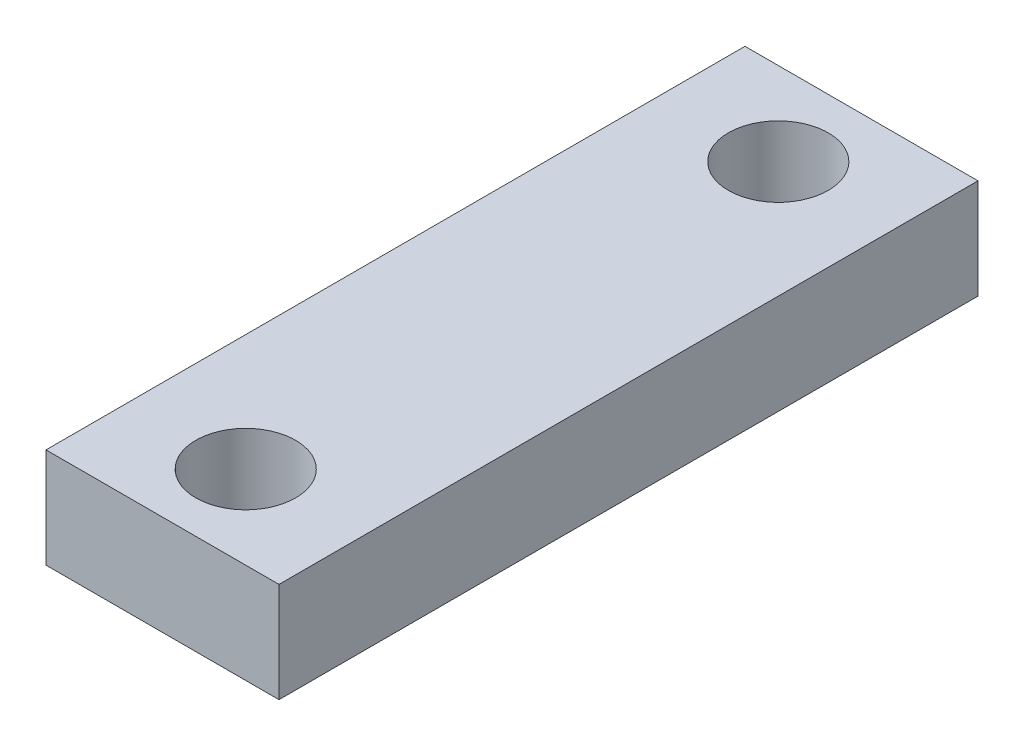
from build123d import *

# Parameters (mm, degrees)
SKETCH1_W           = 14
SKETCH1_H           = 42
SKETCH1_R           = 3
BOSS_EXTRUDE1_DEPTH = 6


with BuildPart() as part:
    # Sketch1 → Boss-Extrude1 (new body)
    with BuildSketch(Plane(origin=(0, 0, 0), x_dir=(1, 0, 0), z_dir=(0, 1, 0))):
        Rectangle(SKETCH1_W, SKETCH1_H)
        with Locations(Location((0, 16, 0), (0, 0, 270))):
            Circle(SKETCH1_R, mode=Mode.SUBTRACT)
        with Locations(Location((0, -16, 0), (0, 0, 270))):
            Circle(SKETCH1_R, mode=Mode.SUBTRACT)
    extrude(amount=BOSS_EXTRUDE1_DEPTH)


solid = part.part
